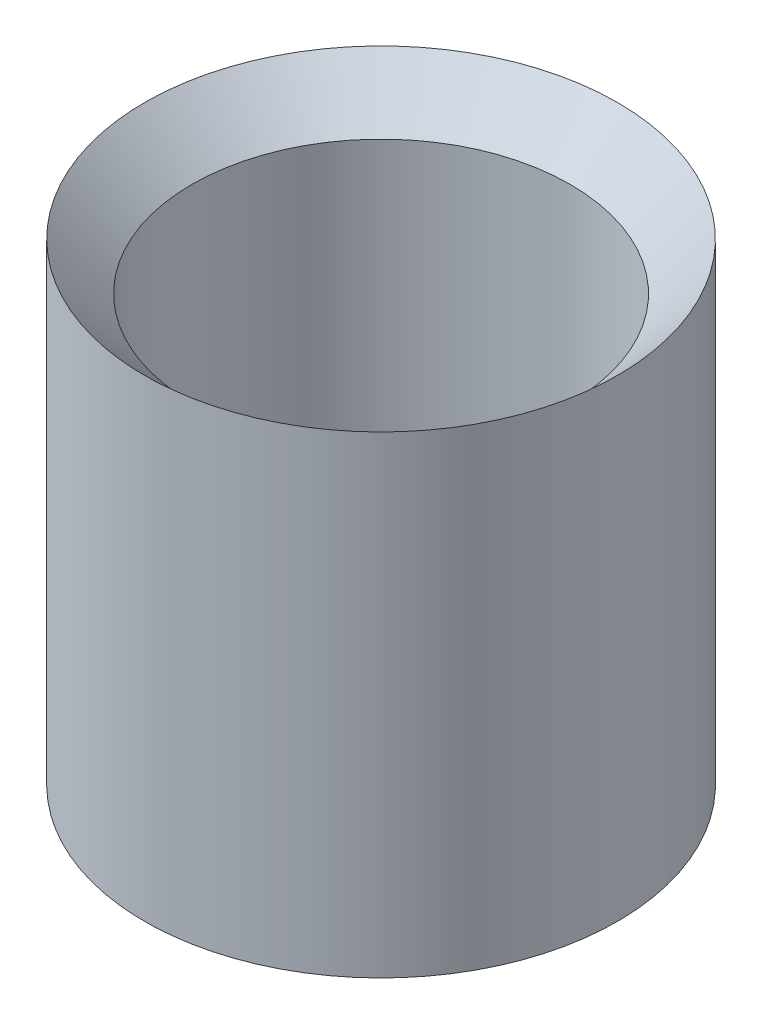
ISO-10303-21;
HEADER;
FILE_DESCRIPTION(('STEP AP214'),'2;1');
FILE_NAME('part.step','',(''),(''),'','','');
FILE_SCHEMA(('AUTOMOTIVE_DESIGN { 1 0 10303 214 1 1 1 1 }'));
ENDSEC;
DATA;
#1=APPLICATION_CONTEXT('core data for automotive mechanical design processes');
#2=APPLICATION_PROTOCOL_DEFINITION('international standard','automotive_design',2000,#1);
#3=PRODUCT_CONTEXT('',#1,'mechanical');
#4=PRODUCT('Part','Part','',(#3));
#5=PRODUCT_RELATED_PRODUCT_CATEGORY('part','',(#4));
#6=PRODUCT_DEFINITION_FORMATION('','',#4);
#7=PRODUCT_DEFINITION_CONTEXT('part definition',#1,'design');
#8=PRODUCT_DEFINITION('design','',#6,#7);
#9=PRODUCT_DEFINITION_SHAPE('','',#8);
#10=(LENGTH_UNIT() NAMED_UNIT(*) SI_UNIT(.MILLI.,.METRE.));
#11=(NAMED_UNIT(*) PLANE_ANGLE_UNIT() SI_UNIT($,.RADIAN.));
#12=(NAMED_UNIT(*) SI_UNIT($,.STERADIAN.) SOLID_ANGLE_UNIT());
#13=UNCERTAINTY_MEASURE_WITH_UNIT(LENGTH_MEASURE(1.E-05),#10,'distance_accuracy_value','');
#14=(GEOMETRIC_REPRESENTATION_CONTEXT(3) GLOBAL_UNCERTAINTY_ASSIGNED_CONTEXT((#13)) GLOBAL_UNIT_ASSIGNED_CONTEXT((#10,
#11,#12)) REPRESENTATION_CONTEXT('',''));
#15=CARTESIAN_POINT('',(0.,0.,0.));
#16=DIRECTION('',(0.,0.,1.));
#17=DIRECTION('',(1.,0.,0.));
#18=AXIS2_PLACEMENT_3D('',#15,#16,#17);
#19=CARTESIAN_POINT('',(-40.,0.,0.));
#20=DIRECTION('',(0.,1.,0.));
#21=DIRECTION('',(0.,0.,1.));
#22=AXIS2_PLACEMENT_3D('',#19,#20,#21);
#23=PLANE('',#22);
#24=CARTESIAN_POINT('',(0.,0.,0.));
#25=DIRECTION('',(0.,-1.,0.));
#26=DIRECTION('',(0.,0.,-1.));
#27=AXIS2_PLACEMENT_3D('',#24,#25,#26);
#28=CIRCLE('',#27,40.);
#29=CARTESIAN_POINT('',(0.,0.,-40.));
#30=VERTEX_POINT('',#29);
#31=EDGE_CURVE('E10',#30,#30,#28,.T.);
#32=ORIENTED_EDGE('',*,*,#31,.F.);
#33=EDGE_LOOP('',(#32));
#34=FACE_BOUND('',#33,.T.);
#35=CARTESIAN_POINT('',(0.,0.,0.));
#36=DIRECTION('',(0.,-1.,0.));
#37=DIRECTION('',(0.,0.,-1.));
#38=AXIS2_PLACEMENT_3D('',#35,#36,#37);
#39=CIRCLE('',#38,50.);
#40=CARTESIAN_POINT('',(0.,0.,-50.));
#41=VERTEX_POINT('',#40);
#42=EDGE_CURVE('E43',#41,#41,#39,.T.);
#43=ORIENTED_EDGE('',*,*,#42,.T.);
#44=EDGE_LOOP('',(#43));
#45=FACE_BOUND('',#44,.T.);
#46=ADVANCED_FACE('F29',(#34,#45),#23,.F.);
#47=CARTESIAN_POINT('',(0.,-73.0614942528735,0.));
#48=DIRECTION('',(0.,-1.,0.));
#49=DIRECTION('',(0.,0.,-1.));
#50=AXIS2_PLACEMENT_3D('',#47,#48,#49);
#51=CYLINDRICAL_SURFACE('',#50,40.);
#52=CARTESIAN_POINT('',(0.,90.,0.));
#53=DIRECTION('',(0.,-1.,0.));
#54=DIRECTION('',(0.,0.,-1.));
#55=AXIS2_PLACEMENT_3D('',#52,#53,#54);
#56=CIRCLE('',#55,40.);
#57=CARTESIAN_POINT('',(0.,90.,-40.));
#58=VERTEX_POINT('',#57);
#59=EDGE_CURVE('E35',#58,#58,#56,.T.);
#60=ORIENTED_EDGE('',*,*,#59,.F.);
#61=EDGE_LOOP('',(#60));
#62=FACE_BOUND('',#61,.T.);
#63=ORIENTED_EDGE('',*,*,#31,.T.);
#64=EDGE_LOOP('',(#63));
#65=FACE_BOUND('',#64,.T.);
#66=ADVANCED_FACE('F58',(#62,#65),#51,.F.);
#67=CARTESIAN_POINT('',(0.,90.,0.));
#68=DIRECTION('',(0.,1.,0.));
#69=DIRECTION('',(0.,0.,1.));
#70=AXIS2_PLACEMENT_3D('',#67,#68,#69);
#71=CONICAL_SURFACE('',#70,40.,0.785398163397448);
#72=CARTESIAN_POINT('',(0.,100.,0.));
#73=DIRECTION('',(0.,-1.,0.));
#74=DIRECTION('',(0.,0.,-1.));
#75=AXIS2_PLACEMENT_3D('',#72,#73,#74);
#76=CIRCLE('',#75,50.);
#77=CARTESIAN_POINT('',(0.,100.,-50.));
#78=VERTEX_POINT('',#77);
#79=EDGE_CURVE('E39',#78,#78,#76,.T.);
#80=ORIENTED_EDGE('',*,*,#79,.F.);
#81=EDGE_LOOP('',(#80));
#82=FACE_BOUND('',#81,.T.);
#83=ORIENTED_EDGE('',*,*,#59,.T.);
#84=EDGE_LOOP('',(#83));
#85=FACE_BOUND('',#84,.T.);
#86=ADVANCED_FACE('F53',(#82,#85),#71,.F.);
#87=CARTESIAN_POINT('',(0.,-73.0614942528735,0.));
#88=DIRECTION('',(0.,-1.,0.));
#89=DIRECTION('',(0.,0.,-1.));
#90=AXIS2_PLACEMENT_3D('',#87,#88,#89);
#91=CYLINDRICAL_SURFACE('',#90,50.);
#92=ORIENTED_EDGE('',*,*,#42,.F.);
#93=EDGE_LOOP('',(#92));
#94=FACE_BOUND('',#93,.T.);
#95=ORIENTED_EDGE('',*,*,#79,.T.);
#96=EDGE_LOOP('',(#95));
#97=FACE_BOUND('',#96,.T.);
#98=ADVANCED_FACE('F50',(#94,#97),#91,.T.);
#99=CLOSED_SHELL('',(#46,#66,#86,#98));
#100=MANIFOLD_SOLID_BREP('B2',#99);
#101=ADVANCED_BREP_SHAPE_REPRESENTATION('',(#18,#100),#14);
#102=SHAPE_DEFINITION_REPRESENTATION(#9,#101);
ENDSEC;
END-ISO-10303-21;
